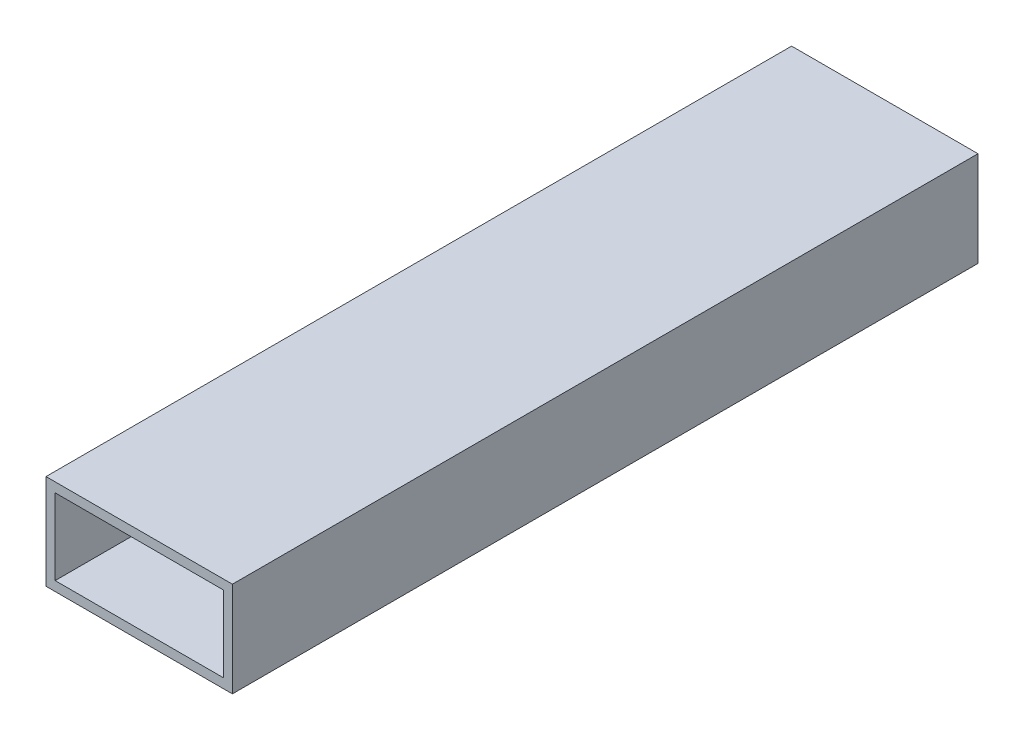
ISO-10303-21;
HEADER;
FILE_DESCRIPTION(('STEP AP214'),'2;1');
FILE_NAME('part.step','',(''),(''),'','','');
FILE_SCHEMA(('AUTOMOTIVE_DESIGN { 1 0 10303 214 1 1 1 1 }'));
ENDSEC;
DATA;
#1=APPLICATION_CONTEXT('core data for automotive mechanical design processes');
#2=APPLICATION_PROTOCOL_DEFINITION('international standard','automotive_design',2000,#1);
#3=PRODUCT_CONTEXT('',#1,'mechanical');
#4=PRODUCT('Part','Part','',(#3));
#5=PRODUCT_RELATED_PRODUCT_CATEGORY('part','',(#4));
#6=PRODUCT_DEFINITION_FORMATION('','',#4);
#7=PRODUCT_DEFINITION_CONTEXT('part definition',#1,'design');
#8=PRODUCT_DEFINITION('design','',#6,#7);
#9=PRODUCT_DEFINITION_SHAPE('','',#8);
#10=(LENGTH_UNIT() NAMED_UNIT(*) SI_UNIT(.MILLI.,.METRE.));
#11=(NAMED_UNIT(*) PLANE_ANGLE_UNIT() SI_UNIT($,.RADIAN.));
#12=(NAMED_UNIT(*) SI_UNIT($,.STERADIAN.) SOLID_ANGLE_UNIT());
#13=UNCERTAINTY_MEASURE_WITH_UNIT(LENGTH_MEASURE(1.E-05),#10,'distance_accuracy_value','');
#14=(GEOMETRIC_REPRESENTATION_CONTEXT(3) GLOBAL_UNCERTAINTY_ASSIGNED_CONTEXT((#13)) GLOBAL_UNIT_ASSIGNED_CONTEXT((#10,
#11,#12)) REPRESENTATION_CONTEXT('',''));
#15=CARTESIAN_POINT('',(0.,0.,0.));
#16=DIRECTION('',(0.,0.,1.));
#17=DIRECTION('',(1.,0.,0.));
#18=AXIS2_PLACEMENT_3D('',#15,#16,#17);
#19=CARTESIAN_POINT('',(0.,0.,102.));
#20=DIRECTION('',(0.,0.,-1.));
#21=DIRECTION('',(-1.,0.,0.));
#22=AXIS2_PLACEMENT_3D('',#19,#20,#21);
#23=PLANE('',#22);
#24=DIRECTION('',(0.,-1.,0.));
#25=VECTOR('',#24,1.);
#26=CARTESIAN_POINT('',(-12.75,6.5,102.));
#27=LINE('',#26,#25);
#28=CARTESIAN_POINT('',(-12.75,6.5,102.));
#29=VERTEX_POINT('',#28);
#30=CARTESIAN_POINT('',(-12.75,-6.5,102.));
#31=VERTEX_POINT('',#30);
#32=EDGE_CURVE('E135',#29,#31,#27,.T.);
#33=ORIENTED_EDGE('',*,*,#32,.T.);
#34=DIRECTION('',(1.,0.,0.));
#35=VECTOR('',#34,1.);
#36=CARTESIAN_POINT('',(12.75,-6.5,102.));
#37=LINE('',#36,#35);
#38=CARTESIAN_POINT('',(12.75,-6.5,102.));
#39=VERTEX_POINT('',#38);
#40=EDGE_CURVE('E138',#31,#39,#37,.T.);
#41=ORIENTED_EDGE('',*,*,#40,.T.);
#42=DIRECTION('',(0.,1.,0.));
#43=VECTOR('',#42,1.);
#44=CARTESIAN_POINT('',(12.75,6.5,102.));
#45=LINE('',#44,#43);
#46=CARTESIAN_POINT('',(12.75,6.5,102.));
#47=VERTEX_POINT('',#46);
#48=EDGE_CURVE('E141',#39,#47,#45,.T.);
#49=ORIENTED_EDGE('',*,*,#48,.T.);
#50=DIRECTION('',(-1.,0.,0.));
#51=VECTOR('',#50,1.);
#52=CARTESIAN_POINT('',(12.75,6.5,102.));
#53=LINE('',#52,#51);
#54=EDGE_CURVE('E143',#47,#29,#53,.T.);
#55=ORIENTED_EDGE('',*,*,#54,.T.);
#56=EDGE_LOOP('',(#33,#41,#49,#55));
#57=FACE_BOUND('',#56,.T.);
#58=DIRECTION('',(0.,1.,0.));
#59=VECTOR('',#58,1.);
#60=CARTESIAN_POINT('',(11.5,5.2,102.));
#61=LINE('',#60,#59);
#62=CARTESIAN_POINT('',(11.5,-5.2,102.));
#63=VERTEX_POINT('',#62);
#64=CARTESIAN_POINT('',(11.5,5.2,102.));
#65=VERTEX_POINT('',#64);
#66=EDGE_CURVE('E99',#63,#65,#61,.T.);
#67=ORIENTED_EDGE('',*,*,#66,.F.);
#68=DIRECTION('',(1.,0.,0.));
#69=VECTOR('',#68,1.);
#70=CARTESIAN_POINT('',(-11.5,-5.2,102.));
#71=LINE('',#70,#69);
#72=CARTESIAN_POINT('',(-11.5,-5.2,102.));
#73=VERTEX_POINT('',#72);
#74=EDGE_CURVE('E121',#73,#63,#71,.T.);
#75=ORIENTED_EDGE('',*,*,#74,.F.);
#76=DIRECTION('',(0.,-1.,0.));
#77=VECTOR('',#76,1.);
#78=CARTESIAN_POINT('',(-11.5,5.2,102.));
#79=LINE('',#78,#77);
#80=CARTESIAN_POINT('',(-11.5,5.2,102.));
#81=VERTEX_POINT('',#80);
#82=EDGE_CURVE('E119',#81,#73,#79,.T.);
#83=ORIENTED_EDGE('',*,*,#82,.F.);
#84=DIRECTION('',(-1.,0.,0.));
#85=VECTOR('',#84,1.);
#86=CARTESIAN_POINT('',(-11.5,5.2,102.));
#87=LINE('',#86,#85);
#88=EDGE_CURVE('E107',#65,#81,#87,.T.);
#89=ORIENTED_EDGE('',*,*,#88,.F.);
#90=EDGE_LOOP('',(#67,#75,#83,#89));
#91=FACE_BOUND('',#90,.T.);
#92=ADVANCED_FACE('F34',(#57,#91),#23,.F.);
#93=CARTESIAN_POINT('',(0.,0.,0.));
#94=DIRECTION('',(0.,0.,-1.));
#95=DIRECTION('',(-1.,0.,0.));
#96=AXIS2_PLACEMENT_3D('',#93,#94,#95);
#97=PLANE('',#96);
#98=DIRECTION('',(0.,-1.,0.));
#99=VECTOR('',#98,1.);
#100=CARTESIAN_POINT('',(-12.75,6.5,0.));
#101=LINE('',#100,#99);
#102=CARTESIAN_POINT('',(-12.75,6.5,0.));
#103=VERTEX_POINT('',#102);
#104=CARTESIAN_POINT('',(-12.75,-6.5,0.));
#105=VERTEX_POINT('',#104);
#106=EDGE_CURVE('E115',#103,#105,#101,.T.);
#107=ORIENTED_EDGE('',*,*,#106,.F.);
#108=DIRECTION('',(-1.,0.,0.));
#109=VECTOR('',#108,1.);
#110=CARTESIAN_POINT('',(12.75,6.5,0.));
#111=LINE('',#110,#109);
#112=CARTESIAN_POINT('',(12.75,6.5,0.));
#113=VERTEX_POINT('',#112);
#114=EDGE_CURVE('E139',#113,#103,#111,.T.);
#115=ORIENTED_EDGE('',*,*,#114,.F.);
#116=DIRECTION('',(0.,1.,0.));
#117=VECTOR('',#116,1.);
#118=CARTESIAN_POINT('',(12.75,6.5,0.));
#119=LINE('',#118,#117);
#120=CARTESIAN_POINT('',(12.75,-6.5,0.));
#121=VERTEX_POINT('',#120);
#122=EDGE_CURVE('E150',#121,#113,#119,.T.);
#123=ORIENTED_EDGE('',*,*,#122,.F.);
#124=DIRECTION('',(1.,0.,0.));
#125=VECTOR('',#124,1.);
#126=CARTESIAN_POINT('',(12.75,-6.5,0.));
#127=LINE('',#126,#125);
#128=EDGE_CURVE('E148',#105,#121,#127,.T.);
#129=ORIENTED_EDGE('',*,*,#128,.F.);
#130=EDGE_LOOP('',(#107,#115,#123,#129));
#131=FACE_BOUND('',#130,.T.);
#132=DIRECTION('',(1.,0.,0.));
#133=VECTOR('',#132,1.);
#134=CARTESIAN_POINT('',(-11.5,-5.2,0.));
#135=LINE('',#134,#133);
#136=CARTESIAN_POINT('',(-11.5,-5.2,0.));
#137=VERTEX_POINT('',#136);
#138=CARTESIAN_POINT('',(11.5,-5.2,0.));
#139=VERTEX_POINT('',#138);
#140=EDGE_CURVE('E108',#137,#139,#135,.T.);
#141=ORIENTED_EDGE('',*,*,#140,.T.);
#142=DIRECTION('',(0.,1.,0.));
#143=VECTOR('',#142,1.);
#144=CARTESIAN_POINT('',(11.5,5.2,0.));
#145=LINE('',#144,#143);
#146=CARTESIAN_POINT('',(11.5,5.2,0.));
#147=VERTEX_POINT('',#146);
#148=EDGE_CURVE('E57',#139,#147,#145,.T.);
#149=ORIENTED_EDGE('',*,*,#148,.T.);
#150=DIRECTION('',(-1.,0.,0.));
#151=VECTOR('',#150,1.);
#152=CARTESIAN_POINT('',(-11.5,5.2,0.));
#153=LINE('',#152,#151);
#154=CARTESIAN_POINT('',(-11.5,5.2,0.));
#155=VERTEX_POINT('',#154);
#156=EDGE_CURVE('E114',#147,#155,#153,.T.);
#157=ORIENTED_EDGE('',*,*,#156,.T.);
#158=DIRECTION('',(0.,-1.,0.));
#159=VECTOR('',#158,1.);
#160=CARTESIAN_POINT('',(-11.5,5.2,0.));
#161=LINE('',#160,#159);
#162=EDGE_CURVE('E127',#155,#137,#161,.T.);
#163=ORIENTED_EDGE('',*,*,#162,.T.);
#164=EDGE_LOOP('',(#141,#149,#157,#163));
#165=FACE_BOUND('',#164,.T.);
#166=ADVANCED_FACE('F168',(#131,#165),#97,.T.);
#167=CARTESIAN_POINT('',(-12.75,6.5,102.));
#168=DIRECTION('',(1.,0.,0.));
#169=DIRECTION('',(0.,0.,-1.));
#170=AXIS2_PLACEMENT_3D('',#167,#168,#169);
#171=PLANE('',#170);
#172=ORIENTED_EDGE('',*,*,#106,.T.);
#173=DIRECTION('',(0.,0.,-1.));
#174=VECTOR('',#173,1.);
#175=CARTESIAN_POINT('',(-12.75,-6.5,102.));
#176=LINE('',#175,#174);
#177=EDGE_CURVE('E11',#31,#105,#176,.T.);
#178=ORIENTED_EDGE('',*,*,#177,.F.);
#179=ORIENTED_EDGE('',*,*,#32,.F.);
#180=DIRECTION('',(0.,0.,-1.));
#181=VECTOR('',#180,1.);
#182=CARTESIAN_POINT('',(-12.75,6.5,102.));
#183=LINE('',#182,#181);
#184=EDGE_CURVE('E145',#29,#103,#183,.T.);
#185=ORIENTED_EDGE('',*,*,#184,.T.);
#186=EDGE_LOOP('',(#172,#178,#179,#185));
#187=FACE_BOUND('',#186,.T.);
#188=ADVANCED_FACE('F36',(#187),#171,.F.);
#189=CARTESIAN_POINT('',(12.75,-6.5,102.));
#190=DIRECTION('',(0.,1.,0.));
#191=DIRECTION('',(-1.,0.,0.));
#192=AXIS2_PLACEMENT_3D('',#189,#190,#191);
#193=PLANE('',#192);
#194=ORIENTED_EDGE('',*,*,#128,.T.);
#195=DIRECTION('',(0.,0.,-1.));
#196=VECTOR('',#195,1.);
#197=CARTESIAN_POINT('',(12.75,-6.5,102.));
#198=LINE('',#197,#196);
#199=EDGE_CURVE('E42',#39,#121,#198,.T.);
#200=ORIENTED_EDGE('',*,*,#199,.F.);
#201=ORIENTED_EDGE('',*,*,#40,.F.);
#202=ORIENTED_EDGE('',*,*,#177,.T.);
#203=EDGE_LOOP('',(#194,#200,#201,#202));
#204=FACE_BOUND('',#203,.T.);
#205=ADVANCED_FACE('F178',(#204),#193,.F.);
#206=CARTESIAN_POINT('',(12.75,6.5,102.));
#207=DIRECTION('',(-1.,0.,0.));
#208=DIRECTION('',(0.,0.,1.));
#209=AXIS2_PLACEMENT_3D('',#206,#207,#208);
#210=PLANE('',#209);
#211=ORIENTED_EDGE('',*,*,#122,.T.);
#212=DIRECTION('',(0.,0.,-1.));
#213=VECTOR('',#212,1.);
#214=CARTESIAN_POINT('',(12.75,6.5,102.));
#215=LINE('',#214,#213);
#216=EDGE_CURVE('E155',#47,#113,#215,.T.);
#217=ORIENTED_EDGE('',*,*,#216,.F.);
#218=ORIENTED_EDGE('',*,*,#48,.F.);
#219=ORIENTED_EDGE('',*,*,#199,.T.);
#220=EDGE_LOOP('',(#211,#217,#218,#219));
#221=FACE_BOUND('',#220,.T.);
#222=ADVANCED_FACE('F162',(#221),#210,.F.);
#223=CARTESIAN_POINT('',(12.75,6.5,102.));
#224=DIRECTION('',(0.,-1.,0.));
#225=DIRECTION('',(1.,0.,0.));
#226=AXIS2_PLACEMENT_3D('',#223,#224,#225);
#227=PLANE('',#226);
#228=ORIENTED_EDGE('',*,*,#114,.T.);
#229=ORIENTED_EDGE('',*,*,#184,.F.);
#230=ORIENTED_EDGE('',*,*,#54,.F.);
#231=ORIENTED_EDGE('',*,*,#216,.T.);
#232=EDGE_LOOP('',(#228,#229,#230,#231));
#233=FACE_BOUND('',#232,.T.);
#234=ADVANCED_FACE('F172',(#233),#227,.F.);
#235=CARTESIAN_POINT('',(11.5,5.2,102.));
#236=DIRECTION('',(-1.,0.,0.));
#237=DIRECTION('',(0.,0.,1.));
#238=AXIS2_PLACEMENT_3D('',#235,#236,#237);
#239=PLANE('',#238);
#240=ORIENTED_EDGE('',*,*,#148,.F.);
#241=DIRECTION('',(0.,0.,-1.));
#242=VECTOR('',#241,1.);
#243=CARTESIAN_POINT('',(11.5,-5.2,102.));
#244=LINE('',#243,#242);
#245=EDGE_CURVE('E103',#63,#139,#244,.T.);
#246=ORIENTED_EDGE('',*,*,#245,.F.);
#247=ORIENTED_EDGE('',*,*,#66,.T.);
#248=DIRECTION('',(0.,0.,-1.));
#249=VECTOR('',#248,1.);
#250=CARTESIAN_POINT('',(11.5,5.2,102.));
#251=LINE('',#250,#249);
#252=EDGE_CURVE('E102',#65,#147,#251,.T.);
#253=ORIENTED_EDGE('',*,*,#252,.T.);
#254=EDGE_LOOP('',(#240,#246,#247,#253));
#255=FACE_BOUND('',#254,.T.);
#256=ADVANCED_FACE('F101',(#255),#239,.T.);
#257=CARTESIAN_POINT('',(-11.5,5.2,102.));
#258=DIRECTION('',(0.,-1.,0.));
#259=DIRECTION('',(0.,0.,-1.));
#260=AXIS2_PLACEMENT_3D('',#257,#258,#259);
#261=PLANE('',#260);
#262=ORIENTED_EDGE('',*,*,#156,.F.);
#263=ORIENTED_EDGE('',*,*,#252,.F.);
#264=ORIENTED_EDGE('',*,*,#88,.T.);
#265=DIRECTION('',(0.,0.,-1.));
#266=VECTOR('',#265,1.);
#267=CARTESIAN_POINT('',(-11.5,5.2,102.));
#268=LINE('',#267,#266);
#269=EDGE_CURVE('E116',#81,#155,#268,.T.);
#270=ORIENTED_EDGE('',*,*,#269,.T.);
#271=EDGE_LOOP('',(#262,#263,#264,#270));
#272=FACE_BOUND('',#271,.T.);
#273=ADVANCED_FACE('F111',(#272),#261,.T.);
#274=CARTESIAN_POINT('',(-11.5,5.2,102.));
#275=DIRECTION('',(1.,0.,0.));
#276=DIRECTION('',(0.,0.,-1.));
#277=AXIS2_PLACEMENT_3D('',#274,#275,#276);
#278=PLANE('',#277);
#279=ORIENTED_EDGE('',*,*,#162,.F.);
#280=ORIENTED_EDGE('',*,*,#269,.F.);
#281=ORIENTED_EDGE('',*,*,#82,.T.);
#282=DIRECTION('',(0.,0.,-1.));
#283=VECTOR('',#282,1.);
#284=CARTESIAN_POINT('',(-11.5,-5.2,102.));
#285=LINE('',#284,#283);
#286=EDGE_CURVE('E49',#73,#137,#285,.T.);
#287=ORIENTED_EDGE('',*,*,#286,.T.);
#288=EDGE_LOOP('',(#279,#280,#281,#287));
#289=FACE_BOUND('',#288,.T.);
#290=ADVANCED_FACE('F201',(#289),#278,.T.);
#291=CARTESIAN_POINT('',(-11.5,-5.2,102.));
#292=DIRECTION('',(0.,1.,0.));
#293=DIRECTION('',(0.,0.,1.));
#294=AXIS2_PLACEMENT_3D('',#291,#292,#293);
#295=PLANE('',#294);
#296=ORIENTED_EDGE('',*,*,#140,.F.);
#297=ORIENTED_EDGE('',*,*,#286,.F.);
#298=ORIENTED_EDGE('',*,*,#74,.T.);
#299=ORIENTED_EDGE('',*,*,#245,.T.);
#300=EDGE_LOOP('',(#296,#297,#298,#299));
#301=FACE_BOUND('',#300,.T.);
#302=ADVANCED_FACE('F205',(#301),#295,.T.);
#303=CLOSED_SHELL('',(#92,#166,#188,#205,#222,#234,#256,#273,#290,#302));
#304=MANIFOLD_SOLID_BREP('B2',#303);
#305=ADVANCED_BREP_SHAPE_REPRESENTATION('',(#18,#304),#14);
#306=SHAPE_DEFINITION_REPRESENTATION(#9,#305);
ENDSEC;
END-ISO-10303-21;
